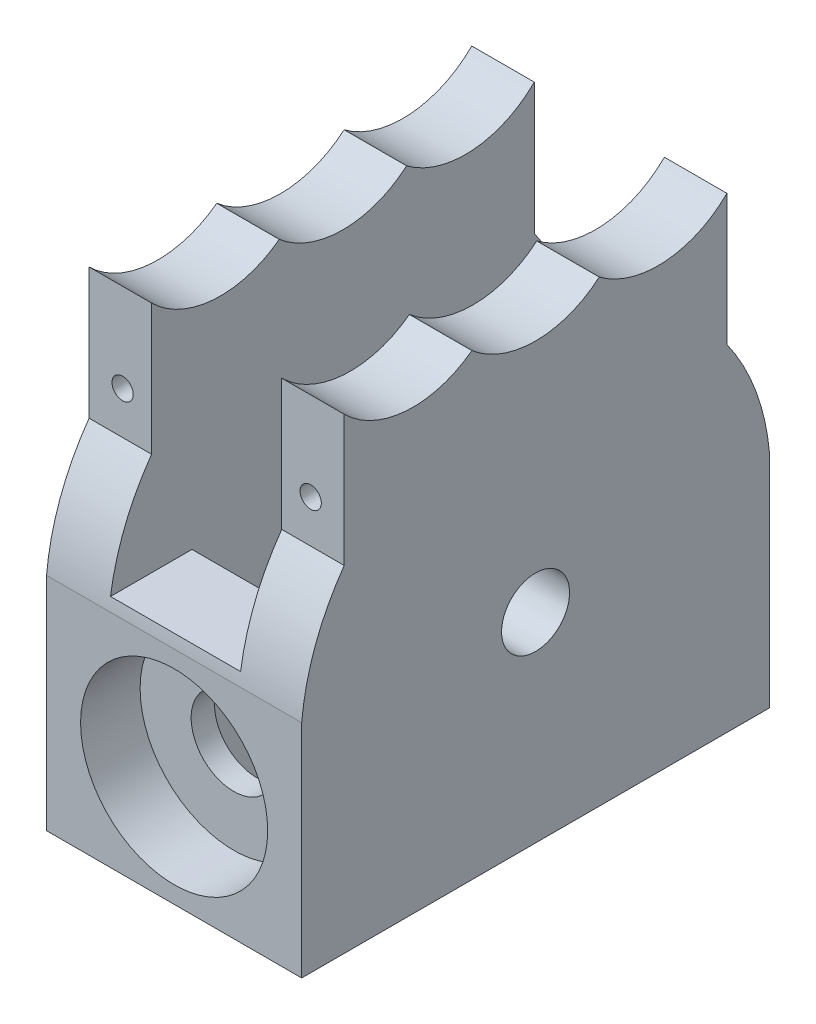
ISO-10303-21;
HEADER;
FILE_DESCRIPTION(('STEP AP214'),'2;1');
FILE_NAME('part.step','',(''),(''),'','','');
FILE_SCHEMA(('AUTOMOTIVE_DESIGN { 1 0 10303 214 1 1 1 1 }'));
ENDSEC;
DATA;
#1=APPLICATION_CONTEXT('core data for automotive mechanical design processes');
#2=APPLICATION_PROTOCOL_DEFINITION('international standard','automotive_design',2000,#1);
#3=PRODUCT_CONTEXT('',#1,'mechanical');
#4=PRODUCT('Part','Part','',(#3));
#5=PRODUCT_RELATED_PRODUCT_CATEGORY('part','',(#4));
#6=PRODUCT_DEFINITION_FORMATION('','',#4);
#7=PRODUCT_DEFINITION_CONTEXT('part definition',#1,'design');
#8=PRODUCT_DEFINITION('design','',#6,#7);
#9=PRODUCT_DEFINITION_SHAPE('','',#8);
#10=(LENGTH_UNIT() NAMED_UNIT(*) SI_UNIT(.MILLI.,.METRE.));
#11=(NAMED_UNIT(*) PLANE_ANGLE_UNIT() SI_UNIT($,.RADIAN.));
#12=(NAMED_UNIT(*) SI_UNIT($,.STERADIAN.) SOLID_ANGLE_UNIT());
#13=UNCERTAINTY_MEASURE_WITH_UNIT(LENGTH_MEASURE(1.E-05),#10,'distance_accuracy_value','');
#14=(GEOMETRIC_REPRESENTATION_CONTEXT(3) GLOBAL_UNCERTAINTY_ASSIGNED_CONTEXT((#13)) GLOBAL_UNIT_ASSIGNED_CONTEXT((#10,
#11,#12)) REPRESENTATION_CONTEXT('',''));
#15=CARTESIAN_POINT('',(0.,0.,0.));
#16=DIRECTION('',(0.,0.,1.));
#17=DIRECTION('',(1.,0.,0.));
#18=AXIS2_PLACEMENT_3D('',#15,#16,#17);
#19=CARTESIAN_POINT('',(42.2649293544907,0.,-22.5));
#20=DIRECTION('',(0.,0.,1.));
#21=DIRECTION('',(0.,-1.,0.));
#22=AXIS2_PLACEMENT_3D('',#19,#20,#21);
#23=PLANE('',#22);
#24=DIRECTION('',(-1.,0.,0.));
#25=VECTOR('',#24,1.);
#26=CARTESIAN_POINT('',(42.2649293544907,26.5078105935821,-22.5));
#27=LINE('',#26,#25);
#28=CARTESIAN_POINT('',(15.,26.5078105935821,-22.5));
#29=VERTEX_POINT('',#28);
#30=CARTESIAN_POINT('',(7.65,26.5078105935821,-22.5));
#31=VERTEX_POINT('',#30);
#32=EDGE_CURVE('E320',#29,#31,#27,.T.);
#33=ORIENTED_EDGE('',*,*,#32,.T.);
#34=DIRECTION('',(0.,1.,0.));
#35=VECTOR('',#34,1.);
#36=CARTESIAN_POINT('',(7.65,0.,-22.5));
#37=LINE('',#36,#35);
#38=CARTESIAN_POINT('',(7.65,41.9067187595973,-22.5));
#39=VERTEX_POINT('',#38);
#40=EDGE_CURVE('E194',#31,#39,#37,.T.);
#41=ORIENTED_EDGE('',*,*,#40,.T.);
#42=DIRECTION('',(-1.,0.,0.));
#43=VECTOR('',#42,1.);
#44=CARTESIAN_POINT('',(42.2649293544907,41.9067187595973,-22.5));
#45=LINE('',#44,#43);
#46=CARTESIAN_POINT('',(15.,41.9067187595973,-22.5));
#47=VERTEX_POINT('',#46);
#48=EDGE_CURVE('E323',#47,#39,#45,.T.);
#49=ORIENTED_EDGE('',*,*,#48,.F.);
#50=DIRECTION('',(0.,-1.,0.));
#51=VECTOR('',#50,1.);
#52=CARTESIAN_POINT('',(15.,0.,-22.5));
#53=LINE('',#52,#51);
#54=EDGE_CURVE('E303',#47,#29,#53,.T.);
#55=ORIENTED_EDGE('',*,*,#54,.T.);
#56=EDGE_LOOP('',(#33,#41,#49,#55));
#57=FACE_BOUND('',#56,.T.);
#58=ADVANCED_FACE('F35',(#57),#23,.F.);
#59=CARTESIAN_POINT('',(42.2649293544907,50.0736536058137,-14.4036319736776));
#60=DIRECTION('',(-1.,0.,0.));
#61=DIRECTION('',(0.,0.,1.));
#62=AXIS2_PLACEMENT_3D('',#59,#60,#61);
#63=CYLINDRICAL_SURFACE('',#62,11.5);
#64=ORIENTED_EDGE('',*,*,#48,.T.);
#65=CARTESIAN_POINT('',(7.65,50.0736536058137,-14.4036319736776));
#66=DIRECTION('',(1.,0.,0.));
#67=DIRECTION('',(0.,0.,-1.));
#68=AXIS2_PLACEMENT_3D('',#65,#66,#67);
#69=CIRCLE('',#68,11.5);
#70=CARTESIAN_POINT('',(7.65,40.8853502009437,-7.48806398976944));
#71=VERTEX_POINT('',#70);
#72=EDGE_CURVE('E257',#39,#71,#69,.F.);
#73=ORIENTED_EDGE('',*,*,#72,.T.);
#74=DIRECTION('',(-1.,0.,0.));
#75=VECTOR('',#74,1.);
#76=CARTESIAN_POINT('',(42.2649293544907,40.8853502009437,-7.48806398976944));
#77=LINE('',#76,#75);
#78=CARTESIAN_POINT('',(15.,40.8853502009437,-7.48806398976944));
#79=VERTEX_POINT('',#78);
#80=EDGE_CURVE('E316',#79,#71,#77,.T.);
#81=ORIENTED_EDGE('',*,*,#80,.F.);
#82=CARTESIAN_POINT('',(15.,50.0736536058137,-14.4036319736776));
#83=DIRECTION('',(-1.,0.,0.));
#84=DIRECTION('',(0.,0.,1.));
#85=AXIS2_PLACEMENT_3D('',#82,#83,#84);
#86=CIRCLE('',#85,11.5);
#87=EDGE_CURVE('E302',#79,#47,#86,.F.);
#88=ORIENTED_EDGE('',*,*,#87,.T.);
#89=EDGE_LOOP('',(#64,#73,#81,#88));
#90=FACE_BOUND('',#89,.T.);
#91=ADVANCED_FACE('F392',(#90),#63,.F.);
#92=CARTESIAN_POINT('',(42.2649293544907,0.,22.5));
#93=DIRECTION('',(0.,0.,1.));
#94=DIRECTION('',(0.,-1.,0.));
#95=AXIS2_PLACEMENT_3D('',#92,#93,#94);
#96=PLANE('',#95);
#97=DIRECTION('',(0.,1.,0.));
#98=VECTOR('',#97,1.);
#99=CARTESIAN_POINT('',(7.65,0.,22.5));
#100=LINE('',#99,#98);
#101=CARTESIAN_POINT('',(7.65,26.5078105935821,22.5));
#102=VERTEX_POINT('',#101);
#103=CARTESIAN_POINT('',(7.65,41.9067187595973,22.5));
#104=VERTEX_POINT('',#103);
#105=EDGE_CURVE('E199',#102,#104,#100,.T.);
#106=ORIENTED_EDGE('',*,*,#105,.F.);
#107=DIRECTION('',(-1.,0.,0.));
#108=VECTOR('',#107,1.);
#109=CARTESIAN_POINT('',(42.2649293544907,26.5078105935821,22.5));
#110=LINE('',#109,#108);
#111=CARTESIAN_POINT('',(15.,26.5078105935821,22.5));
#112=VERTEX_POINT('',#111);
#113=EDGE_CURVE('E293',#112,#102,#110,.T.);
#114=ORIENTED_EDGE('',*,*,#113,.F.);
#115=DIRECTION('',(0.,-1.,0.));
#116=VECTOR('',#115,1.);
#117=CARTESIAN_POINT('',(15.,0.,22.5));
#118=LINE('',#117,#116);
#119=CARTESIAN_POINT('',(15.,41.9067187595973,22.5));
#120=VERTEX_POINT('',#119);
#121=EDGE_CURVE('E277',#120,#112,#118,.T.);
#122=ORIENTED_EDGE('',*,*,#121,.F.);
#123=DIRECTION('',(-1.,0.,0.));
#124=VECTOR('',#123,1.);
#125=CARTESIAN_POINT('',(42.2649293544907,41.9067187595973,22.5));
#126=LINE('',#125,#124);
#127=EDGE_CURVE('E281',#120,#104,#126,.T.);
#128=ORIENTED_EDGE('',*,*,#127,.T.);
#129=EDGE_LOOP('',(#106,#114,#122,#128));
#130=FACE_BOUND('',#129,.T.);
#131=CARTESIAN_POINT('',(11.056594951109,31.5042089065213,22.5));
#132=DIRECTION('',(0.,0.,1.));
#133=DIRECTION('',(0.,-1.,0.));
#134=AXIS2_PLACEMENT_3D('',#131,#132,#133);
#135=CIRCLE('',#134,1.25);
#136=CARTESIAN_POINT('',(11.056594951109,30.2542089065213,22.5));
#137=VERTEX_POINT('',#136);
#138=EDGE_CURVE('E237',#137,#137,#135,.T.);
#139=ORIENTED_EDGE('',*,*,#138,.F.);
#140=EDGE_LOOP('',(#139));
#141=FACE_BOUND('',#140,.T.);
#142=ADVANCED_FACE('F389',(#130,#141),#96,.T.);
#143=CARTESIAN_POINT('',(42.2649293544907,50.0736536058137,14.4036319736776));
#144=DIRECTION('',(-1.,0.,0.));
#145=DIRECTION('',(0.,0.,1.));
#146=AXIS2_PLACEMENT_3D('',#143,#144,#145);
#147=CYLINDRICAL_SURFACE('',#146,11.5);
#148=CARTESIAN_POINT('',(7.65,50.0736536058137,14.4036319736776));
#149=DIRECTION('',(1.,0.,0.));
#150=DIRECTION('',(0.,0.,-1.));
#151=AXIS2_PLACEMENT_3D('',#148,#149,#150);
#152=CIRCLE('',#151,11.5);
#153=CARTESIAN_POINT('',(7.65,40.8853502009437,7.48806398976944));
#154=VERTEX_POINT('',#153);
#155=EDGE_CURVE('E44',#104,#154,#152,.T.);
#156=ORIENTED_EDGE('',*,*,#155,.F.);
#157=ORIENTED_EDGE('',*,*,#127,.F.);
#158=CARTESIAN_POINT('',(15.,50.0736536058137,14.4036319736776));
#159=DIRECTION('',(-1.,0.,0.));
#160=DIRECTION('',(0.,0.,1.));
#161=AXIS2_PLACEMENT_3D('',#158,#159,#160);
#162=CIRCLE('',#161,11.5);
#163=CARTESIAN_POINT('',(15.,40.8853502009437,7.48806398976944));
#164=VERTEX_POINT('',#163);
#165=EDGE_CURVE('E280',#164,#120,#162,.T.);
#166=ORIENTED_EDGE('',*,*,#165,.F.);
#167=DIRECTION('',(-1.,0.,0.));
#168=VECTOR('',#167,1.);
#169=CARTESIAN_POINT('',(42.2649293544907,40.8853502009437,7.48806398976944));
#170=LINE('',#169,#168);
#171=EDGE_CURVE('E297',#164,#154,#170,.T.);
#172=ORIENTED_EDGE('',*,*,#171,.T.);
#173=EDGE_LOOP('',(#156,#157,#166,#172));
#174=FACE_BOUND('',#173,.T.);
#175=ADVANCED_FACE('F391',(#174),#147,.F.);
#176=CARTESIAN_POINT('',(0.,0.,-41.642135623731));
#177=DIRECTION('',(0.,0.,1.));
#178=DIRECTION('',(1.,0.,0.));
#179=AXIS2_PLACEMENT_3D('',#176,#177,#178);
#180=CYLINDRICAL_SURFACE('',#179,5.);
#181=CARTESIAN_POINT('',(0.,0.,17.75));
#182=DIRECTION('',(0.,0.,1.));
#183=DIRECTION('',(1.,0.,0.));
#184=AXIS2_PLACEMENT_3D('',#181,#182,#183);
#185=CIRCLE('',#184,5.);
#186=CARTESIAN_POINT('',(5.,0.,17.75));
#187=VERTEX_POINT('',#186);
#188=EDGE_CURVE('E263',#187,#187,#185,.F.);
#189=ORIENTED_EDGE('',*,*,#188,.T.);
#190=EDGE_LOOP('',(#189));
#191=FACE_BOUND('',#190,.T.);
#192=CARTESIAN_POINT('',(0.,0.,20.5));
#193=DIRECTION('',(0.,0.,1.));
#194=DIRECTION('',(1.,0.,0.));
#195=AXIS2_PLACEMENT_3D('',#192,#193,#194);
#196=CIRCLE('',#195,5.);
#197=CARTESIAN_POINT('',(5.,0.,20.5));
#198=VERTEX_POINT('',#197);
#199=EDGE_CURVE('E350',#198,#198,#196,.F.);
#200=ORIENTED_EDGE('',*,*,#199,.F.);
#201=EDGE_LOOP('',(#200));
#202=FACE_BOUND('',#201,.T.);
#203=ADVANCED_FACE('F400',(#191,#202),#180,.F.);
#204=CARTESIAN_POINT('',(15.,10.5,0.));
#205=DIRECTION('',(-1.,0.,0.));
#206=DIRECTION('',(0.,0.,1.));
#207=AXIS2_PLACEMENT_3D('',#204,#205,#206);
#208=CYLINDRICAL_SURFACE('',#207,4.);
#209=CARTESIAN_POINT('',(-7.65,10.5,0.));
#210=DIRECTION('',(-1.,0.,0.));
#211=DIRECTION('',(0.,0.,1.));
#212=AXIS2_PLACEMENT_3D('',#209,#210,#211);
#213=CIRCLE('',#212,4.);
#214=CARTESIAN_POINT('',(-7.65,10.5,4.));
#215=VERTEX_POINT('',#214);
#216=EDGE_CURVE('E270',#215,#215,#213,.F.);
#217=ORIENTED_EDGE('',*,*,#216,.T.);
#218=EDGE_LOOP('',(#217));
#219=FACE_BOUND('',#218,.T.);
#220=CARTESIAN_POINT('',(-15.,10.5,0.));
#221=DIRECTION('',(-1.,0.,0.));
#222=DIRECTION('',(0.,0.,1.));
#223=AXIS2_PLACEMENT_3D('',#220,#221,#222);
#224=CIRCLE('',#223,4.);
#225=CARTESIAN_POINT('',(-15.,10.5,4.));
#226=VERTEX_POINT('',#225);
#227=EDGE_CURVE('E306',#226,#226,#224,.T.);
#228=ORIENTED_EDGE('',*,*,#227,.T.);
#229=EDGE_LOOP('',(#228));
#230=FACE_BOUND('',#229,.T.);
#231=ADVANCED_FACE('F431',(#219,#230),#208,.F.);
#232=CARTESIAN_POINT('',(42.2649293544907,49.6134025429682,0.));
#233=DIRECTION('',(-1.,0.,0.));
#234=DIRECTION('',(0.,0.,1.));
#235=AXIS2_PLACEMENT_3D('',#232,#233,#234);
#236=CYLINDRICAL_SURFACE('',#235,11.5);
#237=CARTESIAN_POINT('',(-7.65,49.6134025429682,0.));
#238=DIRECTION('',(-1.,0.,0.));
#239=DIRECTION('',(0.,0.,1.));
#240=AXIS2_PLACEMENT_3D('',#237,#238,#239);
#241=CIRCLE('',#240,11.5);
#242=CARTESIAN_POINT('',(-7.65,40.8853502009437,-7.48806398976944));
#243=VERTEX_POINT('',#242);
#244=CARTESIAN_POINT('',(-7.65,40.8853502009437,7.48806398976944));
#245=VERTEX_POINT('',#244);
#246=EDGE_CURVE('E266',#243,#245,#241,.T.);
#247=ORIENTED_EDGE('',*,*,#246,.F.);
#248=CARTESIAN_POINT('',(-15.,40.8853502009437,-7.48806398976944));
#249=VERTEX_POINT('',#248);
#250=EDGE_CURVE('E319',#243,#249,#77,.T.);
#251=ORIENTED_EDGE('',*,*,#250,.T.);
#252=CARTESIAN_POINT('',(-15.,49.6134025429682,0.));
#253=DIRECTION('',(-1.,0.,0.));
#254=DIRECTION('',(0.,0.,1.));
#255=AXIS2_PLACEMENT_3D('',#252,#253,#254);
#256=CIRCLE('',#255,11.5);
#257=CARTESIAN_POINT('',(-15.,40.8853502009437,7.48806398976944));
#258=VERTEX_POINT('',#257);
#259=EDGE_CURVE('E312',#258,#249,#256,.F.);
#260=ORIENTED_EDGE('',*,*,#259,.F.);
#261=EDGE_CURVE('E289',#245,#258,#170,.T.);
#262=ORIENTED_EDGE('',*,*,#261,.F.);
#263=EDGE_LOOP('',(#247,#251,#260,#262));
#264=FACE_BOUND('',#263,.T.);
#265=ADVANCED_FACE('F427',(#264),#236,.F.);
#266=CARTESIAN_POINT('',(75.4622443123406,10.5,0.));
#267=DIRECTION('',(-1.,0.,0.));
#268=DIRECTION('',(0.,0.,1.));
#269=AXIS2_PLACEMENT_3D('',#266,#267,#268);
#270=CYLINDRICAL_SURFACE('',#269,27.6134025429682);
#271=CARTESIAN_POINT('',(7.65,10.5,0.));
#272=DIRECTION('',(1.,0.,0.));
#273=DIRECTION('',(0.,0.,-1.));
#274=AXIS2_PLACEMENT_3D('',#271,#272,#273);
#275=CIRCLE('',#274,27.6134025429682);
#276=CARTESIAN_POINT('',(7.65000000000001,14.4422863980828,-27.3305392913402));
#277=VERTEX_POINT('',#276);
#278=EDGE_CURVE('E187',#31,#277,#275,.F.);
#279=ORIENTED_EDGE('',*,*,#278,.F.);
#280=ORIENTED_EDGE('',*,*,#32,.F.);
#281=CARTESIAN_POINT('',(15.,10.5,0.));
#282=DIRECTION('',(-1.,0.,0.));
#283=DIRECTION('',(0.,0.,1.));
#284=AXIS2_PLACEMENT_3D('',#281,#282,#283);
#285=CIRCLE('',#284,27.6134025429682);
#286=CARTESIAN_POINT('',(15.,13.,-27.5));
#287=VERTEX_POINT('',#286);
#288=EDGE_CURVE('E333',#287,#29,#285,.F.);
#289=ORIENTED_EDGE('',*,*,#288,.F.);
#290=DIRECTION('',(-1.,0.,0.));
#291=VECTOR('',#290,1.);
#292=CARTESIAN_POINT('',(-15.,13.,-27.5));
#293=LINE('',#292,#291);
#294=CARTESIAN_POINT('',(-15.,13.,-27.5));
#295=VERTEX_POINT('',#294);
#296=EDGE_CURVE('E368',#287,#295,#293,.T.);
#297=ORIENTED_EDGE('',*,*,#296,.T.);
#298=CARTESIAN_POINT('',(-15.,10.5,0.));
#299=DIRECTION('',(-1.,0.,0.));
#300=DIRECTION('',(0.,0.,1.));
#301=AXIS2_PLACEMENT_3D('',#298,#299,#300);
#302=CIRCLE('',#301,27.6134025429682);
#303=CARTESIAN_POINT('',(-15.,26.5078105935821,-22.5));
#304=VERTEX_POINT('',#303);
#305=EDGE_CURVE('E330',#304,#295,#302,.T.);
#306=ORIENTED_EDGE('',*,*,#305,.F.);
#307=CARTESIAN_POINT('',(-7.65,26.5078105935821,-22.5));
#308=VERTEX_POINT('',#307);
#309=EDGE_CURVE('E322',#308,#304,#27,.T.);
#310=ORIENTED_EDGE('',*,*,#309,.F.);
#311=CARTESIAN_POINT('',(-7.64999999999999,10.5,0.));
#312=DIRECTION('',(-1.,0.,0.));
#313=DIRECTION('',(0.,0.,1.));
#314=AXIS2_PLACEMENT_3D('',#311,#312,#313);
#315=CIRCLE('',#314,27.6134025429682);
#316=CARTESIAN_POINT('',(-7.64999999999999,14.4422863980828,-27.3305392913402));
#317=VERTEX_POINT('',#316);
#318=EDGE_CURVE('E212',#317,#308,#315,.F.);
#319=ORIENTED_EDGE('',*,*,#318,.F.);
#320=DIRECTION('',(-1.,0.,0.));
#321=VECTOR('',#320,1.);
#322=CARTESIAN_POINT('',(75.4622443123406,14.4422863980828,-27.3305392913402));
#323=LINE('',#322,#321);
#324=EDGE_CURVE('E203',#277,#317,#323,.T.);
#325=ORIENTED_EDGE('',*,*,#324,.F.);
#326=EDGE_LOOP('',(#279,#280,#289,#297,#306,#310,#319,#325));
#327=FACE_BOUND('',#326,.T.);
#328=ADVANCED_FACE('F210',(#327),#270,.T.);
#329=CARTESIAN_POINT('',(7.65,10.5,0.));
#330=DIRECTION('',(1.,0.,0.));
#331=DIRECTION('',(0.,0.,-1.));
#332=AXIS2_PLACEMENT_3D('',#329,#330,#331);
#333=CIRCLE('',#332,27.6134025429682);
#334=CARTESIAN_POINT('',(7.65000000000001,14.4422863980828,27.3305392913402));
#335=VERTEX_POINT('',#334);
#336=EDGE_CURVE('E229',#335,#102,#333,.F.);
#337=ORIENTED_EDGE('',*,*,#336,.F.);
#338=DIRECTION('',(-1.,0.,0.));
#339=VECTOR('',#338,1.);
#340=CARTESIAN_POINT('',(75.4622443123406,14.4422863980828,27.3305392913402));
#341=LINE('',#340,#339);
#342=CARTESIAN_POINT('',(-7.64999999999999,14.4422863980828,27.3305392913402));
#343=VERTEX_POINT('',#342);
#344=EDGE_CURVE('E214',#343,#335,#341,.F.);
#345=ORIENTED_EDGE('',*,*,#344,.F.);
#346=CARTESIAN_POINT('',(-7.64999999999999,10.5,0.));
#347=DIRECTION('',(-1.,0.,0.));
#348=DIRECTION('',(0.,0.,1.));
#349=AXIS2_PLACEMENT_3D('',#346,#347,#348);
#350=CIRCLE('',#349,27.6134025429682);
#351=CARTESIAN_POINT('',(-7.65,26.5078105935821,22.5));
#352=VERTEX_POINT('',#351);
#353=EDGE_CURVE('E216',#352,#343,#350,.F.);
#354=ORIENTED_EDGE('',*,*,#353,.F.);
#355=CARTESIAN_POINT('',(-15.,26.5078105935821,22.5));
#356=VERTEX_POINT('',#355);
#357=EDGE_CURVE('E296',#352,#356,#110,.T.);
#358=ORIENTED_EDGE('',*,*,#357,.T.);
#359=CARTESIAN_POINT('',(-15.,13.,27.5));
#360=VERTEX_POINT('',#359);
#361=EDGE_CURVE('E338',#360,#356,#302,.T.);
#362=ORIENTED_EDGE('',*,*,#361,.F.);
#363=DIRECTION('',(-1.,0.,0.));
#364=VECTOR('',#363,1.);
#365=CARTESIAN_POINT('',(-15.,13.,27.5));
#366=LINE('',#365,#364);
#367=CARTESIAN_POINT('',(15.,13.,27.5));
#368=VERTEX_POINT('',#367);
#369=EDGE_CURVE('E357',#368,#360,#366,.T.);
#370=ORIENTED_EDGE('',*,*,#369,.F.);
#371=EDGE_CURVE('E337',#112,#368,#285,.F.);
#372=ORIENTED_EDGE('',*,*,#371,.F.);
#373=ORIENTED_EDGE('',*,*,#113,.T.);
#374=EDGE_LOOP('',(#337,#345,#354,#358,#362,#370,#372,#373));
#375=FACE_BOUND('',#374,.T.);
#376=ADVANCED_FACE('F463',(#375),#270,.T.);
#377=CARTESIAN_POINT('',(0.,0.,-17.75));
#378=DIRECTION('',(0.,0.,-1.));
#379=DIRECTION('',(-1.,0.,0.));
#380=AXIS2_PLACEMENT_3D('',#377,#378,#379);
#381=CIRCLE('',#380,5.);
#382=CARTESIAN_POINT('',(-5.,0.,-17.75));
#383=VERTEX_POINT('',#382);
#384=EDGE_CURVE('E273',#383,#383,#381,.F.);
#385=ORIENTED_EDGE('',*,*,#384,.T.);
#386=EDGE_LOOP('',(#385));
#387=FACE_BOUND('',#386,.T.);
#388=CARTESIAN_POINT('',(0.,0.,-20.5));
#389=DIRECTION('',(0.,0.,-1.));
#390=DIRECTION('',(-1.,0.,0.));
#391=AXIS2_PLACEMENT_3D('',#388,#389,#390);
#392=CIRCLE('',#391,5.);
#393=CARTESIAN_POINT('',(-5.,0.,-20.5));
#394=VERTEX_POINT('',#393);
#395=EDGE_CURVE('E344',#394,#394,#392,.F.);
#396=ORIENTED_EDGE('',*,*,#395,.F.);
#397=EDGE_LOOP('',(#396));
#398=FACE_BOUND('',#397,.T.);
#399=ADVANCED_FACE('F518',(#387,#398),#180,.F.);
#400=CARTESIAN_POINT('',(15.,-13.,27.5));
#401=DIRECTION('',(-1.,0.,0.));
#402=DIRECTION('',(0.,0.,1.));
#403=AXIS2_PLACEMENT_3D('',#400,#401,#402);
#404=PLANE('',#403);
#405=CARTESIAN_POINT('',(15.,10.5,0.));
#406=DIRECTION('',(-1.,0.,0.));
#407=DIRECTION('',(0.,0.,1.));
#408=AXIS2_PLACEMENT_3D('',#405,#406,#407);
#409=CIRCLE('',#408,4.);
#410=CARTESIAN_POINT('',(15.,10.5,4.));
#411=VERTEX_POINT('',#410);
#412=EDGE_CURVE('E327',#411,#411,#409,.T.);
#413=ORIENTED_EDGE('',*,*,#412,.T.);
#414=EDGE_LOOP('',(#413));
#415=FACE_BOUND('',#414,.T.);
#416=DIRECTION('',(0.,1.,0.));
#417=VECTOR('',#416,1.);
#418=CARTESIAN_POINT('',(15.,-13.,-27.5));
#419=LINE('',#418,#417);
#420=CARTESIAN_POINT('',(15.,-13.,-27.5));
#421=VERTEX_POINT('',#420);
#422=EDGE_CURVE('E365',#421,#287,#419,.T.);
#423=ORIENTED_EDGE('',*,*,#422,.T.);
#424=ORIENTED_EDGE('',*,*,#288,.T.);
#425=ORIENTED_EDGE('',*,*,#54,.F.);
#426=ORIENTED_EDGE('',*,*,#87,.F.);
#427=CARTESIAN_POINT('',(15.,49.6134025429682,0.));
#428=DIRECTION('',(-1.,0.,0.));
#429=DIRECTION('',(0.,0.,1.));
#430=AXIS2_PLACEMENT_3D('',#427,#428,#429);
#431=CIRCLE('',#430,11.5);
#432=EDGE_CURVE('E300',#79,#164,#431,.T.);
#433=ORIENTED_EDGE('',*,*,#432,.T.);
#434=ORIENTED_EDGE('',*,*,#165,.T.);
#435=ORIENTED_EDGE('',*,*,#121,.T.);
#436=ORIENTED_EDGE('',*,*,#371,.T.);
#437=DIRECTION('',(0.,1.,0.));
#438=VECTOR('',#437,1.);
#439=CARTESIAN_POINT('',(15.,-13.,27.5));
#440=LINE('',#439,#438);
#441=CARTESIAN_POINT('',(15.,-13.,27.5));
#442=VERTEX_POINT('',#441);
#443=EDGE_CURVE('E354',#442,#368,#440,.T.);
#444=ORIENTED_EDGE('',*,*,#443,.F.);
#445=DIRECTION('',(0.,0.,-1.));
#446=VECTOR('',#445,1.);
#447=CARTESIAN_POINT('',(15.,-13.,27.5));
#448=LINE('',#447,#446);
#449=EDGE_CURVE('E364',#442,#421,#448,.T.);
#450=ORIENTED_EDGE('',*,*,#449,.T.);
#451=EDGE_LOOP('',(#423,#424,#425,#426,#433,#434,#435,#436,#444,#450));
#452=FACE_BOUND('',#451,.T.);
#453=ADVANCED_FACE('F37',(#415,#452),#404,.F.);
#454=CARTESIAN_POINT('',(-15.,-13.,27.5));
#455=DIRECTION('',(1.,0.,0.));
#456=DIRECTION('',(0.,0.,-1.));
#457=AXIS2_PLACEMENT_3D('',#454,#455,#456);
#458=PLANE('',#457);
#459=ORIENTED_EDGE('',*,*,#227,.F.);
#460=EDGE_LOOP('',(#459));
#461=FACE_BOUND('',#460,.T.);
#462=DIRECTION('',(0.,-1.,0.));
#463=VECTOR('',#462,1.);
#464=CARTESIAN_POINT('',(-15.,-13.,-27.5));
#465=LINE('',#464,#463);
#466=CARTESIAN_POINT('',(-15.,-13.,-27.5));
#467=VERTEX_POINT('',#466);
#468=EDGE_CURVE('E371',#295,#467,#465,.T.);
#469=ORIENTED_EDGE('',*,*,#468,.T.);
#470=DIRECTION('',(0.,0.,-1.));
#471=VECTOR('',#470,1.);
#472=CARTESIAN_POINT('',(-15.,-13.,27.5));
#473=LINE('',#472,#471);
#474=CARTESIAN_POINT('',(-15.,-13.,27.5));
#475=VERTEX_POINT('',#474);
#476=EDGE_CURVE('E376',#475,#467,#473,.T.);
#477=ORIENTED_EDGE('',*,*,#476,.F.);
#478=DIRECTION('',(0.,-1.,0.));
#479=VECTOR('',#478,1.);
#480=CARTESIAN_POINT('',(-15.,-13.,27.5));
#481=LINE('',#480,#479);
#482=EDGE_CURVE('E360',#360,#475,#481,.T.);
#483=ORIENTED_EDGE('',*,*,#482,.F.);
#484=ORIENTED_EDGE('',*,*,#361,.T.);
#485=DIRECTION('',(0.,1.,0.));
#486=VECTOR('',#485,1.);
#487=CARTESIAN_POINT('',(-15.,0.,22.5));
#488=LINE('',#487,#486);
#489=CARTESIAN_POINT('',(-15.,41.9067187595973,22.5));
#490=VERTEX_POINT('',#489);
#491=EDGE_CURVE('E286',#356,#490,#488,.T.);
#492=ORIENTED_EDGE('',*,*,#491,.T.);
#493=CARTESIAN_POINT('',(-15.,50.0736536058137,14.4036319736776));
#494=DIRECTION('',(1.,0.,0.));
#495=DIRECTION('',(0.,0.,-1.));
#496=AXIS2_PLACEMENT_3D('',#493,#494,#495);
#497=CIRCLE('',#496,11.5);
#498=EDGE_CURVE('E276',#490,#258,#497,.T.);
#499=ORIENTED_EDGE('',*,*,#498,.T.);
#500=ORIENTED_EDGE('',*,*,#259,.T.);
#501=CARTESIAN_POINT('',(-15.,50.0736536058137,-14.4036319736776));
#502=DIRECTION('',(-1.,0.,0.));
#503=DIRECTION('',(0.,0.,1.));
#504=AXIS2_PLACEMENT_3D('',#501,#502,#503);
#505=CIRCLE('',#504,11.5);
#506=CARTESIAN_POINT('',(-15.,41.9067187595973,-22.5));
#507=VERTEX_POINT('',#506);
#508=EDGE_CURVE('E283',#507,#249,#505,.T.);
#509=ORIENTED_EDGE('',*,*,#508,.F.);
#510=DIRECTION('',(0.,1.,0.));
#511=VECTOR('',#510,1.);
#512=CARTESIAN_POINT('',(-15.,0.,-22.5));
#513=LINE('',#512,#511);
#514=EDGE_CURVE('E309',#304,#507,#513,.T.);
#515=ORIENTED_EDGE('',*,*,#514,.F.);
#516=ORIENTED_EDGE('',*,*,#305,.T.);
#517=EDGE_LOOP('',(#469,#477,#483,#484,#492,#499,#500,#509,#515,#516));
#518=FACE_BOUND('',#517,.T.);
#519=ADVANCED_FACE('F486',(#461,#518),#458,.F.);
#520=CARTESIAN_POINT('',(-15.,-13.,27.5));
#521=DIRECTION('',(0.,1.,0.));
#522=DIRECTION('',(0.,0.,1.));
#523=AXIS2_PLACEMENT_3D('',#520,#521,#522);
#524=PLANE('',#523);
#525=DIRECTION('',(1.,0.,0.));
#526=VECTOR('',#525,1.);
#527=CARTESIAN_POINT('',(7.65,-13.,-17.75));
#528=LINE('',#527,#526);
#529=CARTESIAN_POINT('',(-7.65,-13.,-17.75));
#530=VERTEX_POINT('',#529);
#531=CARTESIAN_POINT('',(7.65,-13.,-17.75));
#532=VERTEX_POINT('',#531);
#533=EDGE_CURVE('E240',#530,#532,#528,.T.);
#534=ORIENTED_EDGE('',*,*,#533,.F.);
#535=DIRECTION('',(0.,0.,-1.));
#536=VECTOR('',#535,1.);
#537=CARTESIAN_POINT('',(-7.65,-13.,-17.75));
#538=LINE('',#537,#536);
#539=CARTESIAN_POINT('',(-7.65,-13.,17.75));
#540=VERTEX_POINT('',#539);
#541=EDGE_CURVE('E238',#540,#530,#538,.T.);
#542=ORIENTED_EDGE('',*,*,#541,.F.);
#543=DIRECTION('',(-1.,0.,0.));
#544=VECTOR('',#543,1.);
#545=CARTESIAN_POINT('',(7.65,-13.,17.75));
#546=LINE('',#545,#544);
#547=CARTESIAN_POINT('',(7.65,-13.,17.75));
#548=VERTEX_POINT('',#547);
#549=EDGE_CURVE('E245',#548,#540,#546,.T.);
#550=ORIENTED_EDGE('',*,*,#549,.F.);
#551=DIRECTION('',(0.,0.,1.));
#552=VECTOR('',#551,1.);
#553=CARTESIAN_POINT('',(7.65,-13.,-17.75));
#554=LINE('',#553,#552);
#555=EDGE_CURVE('E242',#532,#548,#554,.T.);
#556=ORIENTED_EDGE('',*,*,#555,.F.);
#557=EDGE_LOOP('',(#534,#542,#550,#556));
#558=FACE_BOUND('',#557,.T.);
#559=DIRECTION('',(1.,0.,0.));
#560=VECTOR('',#559,1.);
#561=CARTESIAN_POINT('',(-15.,-13.,-27.5));
#562=LINE('',#561,#560);
#563=EDGE_CURVE('E358',#467,#421,#562,.T.);
#564=ORIENTED_EDGE('',*,*,#563,.T.);
#565=ORIENTED_EDGE('',*,*,#449,.F.);
#566=DIRECTION('',(1.,0.,0.));
#567=VECTOR('',#566,1.);
#568=CARTESIAN_POINT('',(-15.,-13.,27.5));
#569=LINE('',#568,#567);
#570=EDGE_CURVE('E362',#475,#442,#569,.T.);
#571=ORIENTED_EDGE('',*,*,#570,.F.);
#572=ORIENTED_EDGE('',*,*,#476,.T.);
#573=EDGE_LOOP('',(#564,#565,#571,#572));
#574=FACE_BOUND('',#573,.T.);
#575=ADVANCED_FACE('F452',(#558,#574),#524,.F.);
#576=CARTESIAN_POINT('',(0.,0.,27.5));
#577=DIRECTION('',(0.,0.,-1.));
#578=DIRECTION('',(-1.,0.,0.));
#579=AXIS2_PLACEMENT_3D('',#576,#577,#578);
#580=PLANE('',#579);
#581=CARTESIAN_POINT('',(0.,0.,27.5));
#582=DIRECTION('',(0.,0.,1.));
#583=DIRECTION('',(1.,0.,0.));
#584=AXIS2_PLACEMENT_3D('',#581,#582,#583);
#585=CIRCLE('',#584,11.);
#586=CARTESIAN_POINT('',(11.,0.,27.5));
#587=VERTEX_POINT('',#586);
#588=EDGE_CURVE('E351',#587,#587,#585,.T.);
#589=ORIENTED_EDGE('',*,*,#588,.F.);
#590=EDGE_LOOP('',(#589));
#591=FACE_BOUND('',#590,.T.);
#592=ORIENTED_EDGE('',*,*,#443,.T.);
#593=ORIENTED_EDGE('',*,*,#369,.T.);
#594=ORIENTED_EDGE('',*,*,#482,.T.);
#595=ORIENTED_EDGE('',*,*,#570,.T.);
#596=EDGE_LOOP('',(#592,#593,#594,#595));
#597=FACE_BOUND('',#596,.T.);
#598=ADVANCED_FACE('F503',(#591,#597),#580,.F.);
#599=CARTESIAN_POINT('',(0.,0.,-27.5));
#600=DIRECTION('',(0.,0.,-1.));
#601=DIRECTION('',(-1.,0.,0.));
#602=AXIS2_PLACEMENT_3D('',#599,#600,#601);
#603=PLANE('',#602);
#604=CARTESIAN_POINT('',(0.,0.,-27.5));
#605=DIRECTION('',(0.,0.,1.));
#606=DIRECTION('',(1.,0.,0.));
#607=AXIS2_PLACEMENT_3D('',#604,#605,#606);
#608=CIRCLE('',#607,11.);
#609=CARTESIAN_POINT('',(11.,0.,-27.5));
#610=VERTEX_POINT('',#609);
#611=EDGE_CURVE('E336',#610,#610,#608,.T.);
#612=ORIENTED_EDGE('',*,*,#611,.T.);
#613=EDGE_LOOP('',(#612));
#614=FACE_BOUND('',#613,.T.);
#615=ORIENTED_EDGE('',*,*,#422,.F.);
#616=ORIENTED_EDGE('',*,*,#563,.F.);
#617=ORIENTED_EDGE('',*,*,#468,.F.);
#618=ORIENTED_EDGE('',*,*,#296,.F.);
#619=EDGE_LOOP('',(#615,#616,#617,#618));
#620=FACE_BOUND('',#619,.T.);
#621=ADVANCED_FACE('F482',(#614,#620),#603,.T.);
#622=CARTESIAN_POINT('',(0.,0.,20.5));
#623=DIRECTION('',(0.,0.,1.));
#624=DIRECTION('',(1.,0.,0.));
#625=AXIS2_PLACEMENT_3D('',#622,#623,#624);
#626=PLANE('',#625);
#627=CARTESIAN_POINT('',(0.,0.,20.5));
#628=DIRECTION('',(0.,0.,1.));
#629=DIRECTION('',(1.,0.,0.));
#630=AXIS2_PLACEMENT_3D('',#627,#628,#629);
#631=CIRCLE('',#630,11.);
#632=CARTESIAN_POINT('',(11.,0.,20.5));
#633=VERTEX_POINT('',#632);
#634=EDGE_CURVE('E347',#633,#633,#631,.T.);
#635=ORIENTED_EDGE('',*,*,#634,.T.);
#636=EDGE_LOOP('',(#635));
#637=FACE_BOUND('',#636,.T.);
#638=ORIENTED_EDGE('',*,*,#199,.T.);
#639=EDGE_LOOP('',(#638));
#640=FACE_BOUND('',#639,.T.);
#641=ADVANCED_FACE('F515',(#637,#640),#626,.T.);
#642=CARTESIAN_POINT('',(0.,0.,20.5));
#643=DIRECTION('',(0.,0.,1.));
#644=DIRECTION('',(1.,0.,0.));
#645=AXIS2_PLACEMENT_3D('',#642,#643,#644);
#646=CYLINDRICAL_SURFACE('',#645,11.);
#647=ORIENTED_EDGE('',*,*,#634,.F.);
#648=EDGE_LOOP('',(#647));
#649=FACE_BOUND('',#648,.T.);
#650=ORIENTED_EDGE('',*,*,#588,.T.);
#651=EDGE_LOOP('',(#650));
#652=FACE_BOUND('',#651,.T.);
#653=ADVANCED_FACE('F522',(#649,#652),#646,.F.);
#654=CARTESIAN_POINT('',(0.,0.,-20.5));
#655=DIRECTION('',(0.,0.,-1.));
#656=DIRECTION('',(1.,0.,0.));
#657=AXIS2_PLACEMENT_3D('',#654,#655,#656);
#658=PLANE('',#657);
#659=CARTESIAN_POINT('',(0.,0.,-20.5));
#660=DIRECTION('',(0.,0.,1.));
#661=DIRECTION('',(1.,0.,0.));
#662=AXIS2_PLACEMENT_3D('',#659,#660,#661);
#663=CIRCLE('',#662,11.);
#664=CARTESIAN_POINT('',(11.,0.,-20.5));
#665=VERTEX_POINT('',#664);
#666=EDGE_CURVE('E341',#665,#665,#663,.T.);
#667=ORIENTED_EDGE('',*,*,#666,.F.);
#668=EDGE_LOOP('',(#667));
#669=FACE_BOUND('',#668,.T.);
#670=ORIENTED_EDGE('',*,*,#395,.T.);
#671=EDGE_LOOP('',(#670));
#672=FACE_BOUND('',#671,.T.);
#673=ADVANCED_FACE('F525',(#669,#672),#658,.T.);
#674=CARTESIAN_POINT('',(0.,0.,-20.5));
#675=DIRECTION('',(0.,0.,-1.));
#676=DIRECTION('',(-1.,0.,0.));
#677=AXIS2_PLACEMENT_3D('',#674,#675,#676);
#678=CYLINDRICAL_SURFACE('',#677,11.);
#679=ORIENTED_EDGE('',*,*,#666,.T.);
#680=EDGE_LOOP('',(#679));
#681=FACE_BOUND('',#680,.T.);
#682=ORIENTED_EDGE('',*,*,#611,.F.);
#683=EDGE_LOOP('',(#682));
#684=FACE_BOUND('',#683,.T.);
#685=ADVANCED_FACE('F428',(#681,#684),#678,.F.);
#686=CARTESIAN_POINT('',(7.65,10.5,0.));
#687=DIRECTION('',(1.,0.,0.));
#688=DIRECTION('',(0.,0.,-1.));
#689=AXIS2_PLACEMENT_3D('',#686,#687,#688);
#690=CIRCLE('',#689,4.);
#691=CARTESIAN_POINT('',(7.65,10.5,-4.));
#692=VERTEX_POINT('',#691);
#693=EDGE_CURVE('E260',#692,#692,#690,.F.);
#694=ORIENTED_EDGE('',*,*,#693,.T.);
#695=EDGE_LOOP('',(#694));
#696=FACE_BOUND('',#695,.T.);
#697=ORIENTED_EDGE('',*,*,#412,.F.);
#698=EDGE_LOOP('',(#697));
#699=FACE_BOUND('',#698,.T.);
#700=ADVANCED_FACE('F420',(#696,#699),#208,.F.);
#701=CARTESIAN_POINT('',(-7.65,41.9067187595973,-22.5));
#702=VERTEX_POINT('',#701);
#703=EDGE_CURVE('E315',#702,#507,#45,.T.);
#704=ORIENTED_EDGE('',*,*,#703,.F.);
#705=DIRECTION('',(0.,-1.,0.));
#706=VECTOR('',#705,1.);
#707=CARTESIAN_POINT('',(-7.65,0.,-22.5));
#708=LINE('',#707,#706);
#709=EDGE_CURVE('E222',#702,#308,#708,.T.);
#710=ORIENTED_EDGE('',*,*,#709,.T.);
#711=ORIENTED_EDGE('',*,*,#309,.T.);
#712=ORIENTED_EDGE('',*,*,#514,.T.);
#713=EDGE_LOOP('',(#704,#710,#711,#712));
#714=FACE_BOUND('',#713,.T.);
#715=ADVANCED_FACE('F414',(#714),#23,.F.);
#716=CARTESIAN_POINT('',(7.65,49.6134025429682,0.));
#717=DIRECTION('',(1.,0.,0.));
#718=DIRECTION('',(0.,0.,-1.));
#719=AXIS2_PLACEMENT_3D('',#716,#717,#718);
#720=CIRCLE('',#719,11.5);
#721=EDGE_CURVE('E250',#154,#71,#720,.T.);
#722=ORIENTED_EDGE('',*,*,#721,.F.);
#723=ORIENTED_EDGE('',*,*,#171,.F.);
#724=ORIENTED_EDGE('',*,*,#432,.F.);
#725=ORIENTED_EDGE('',*,*,#80,.T.);
#726=EDGE_LOOP('',(#722,#723,#724,#725));
#727=FACE_BOUND('',#726,.T.);
#728=ADVANCED_FACE('F419',(#727),#236,.F.);
#729=CARTESIAN_POINT('',(-7.65,50.0736536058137,-14.4036319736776));
#730=DIRECTION('',(-1.,0.,0.));
#731=DIRECTION('',(0.,0.,1.));
#732=AXIS2_PLACEMENT_3D('',#729,#730,#731);
#733=CIRCLE('',#732,11.5);
#734=EDGE_CURVE('E268',#243,#702,#733,.F.);
#735=ORIENTED_EDGE('',*,*,#734,.T.);
#736=ORIENTED_EDGE('',*,*,#703,.T.);
#737=ORIENTED_EDGE('',*,*,#508,.T.);
#738=ORIENTED_EDGE('',*,*,#250,.F.);
#739=EDGE_LOOP('',(#735,#736,#737,#738));
#740=FACE_BOUND('',#739,.T.);
#741=ADVANCED_FACE('F406',(#740),#63,.F.);
#742=DIRECTION('',(0.,-1.,0.));
#743=VECTOR('',#742,1.);
#744=CARTESIAN_POINT('',(-7.65,0.,22.5));
#745=LINE('',#744,#743);
#746=CARTESIAN_POINT('',(-7.65,41.9067187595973,22.5));
#747=VERTEX_POINT('',#746);
#748=EDGE_CURVE('E213',#747,#352,#745,.T.);
#749=ORIENTED_EDGE('',*,*,#748,.F.);
#750=EDGE_CURVE('E292',#747,#490,#126,.T.);
#751=ORIENTED_EDGE('',*,*,#750,.T.);
#752=ORIENTED_EDGE('',*,*,#491,.F.);
#753=ORIENTED_EDGE('',*,*,#357,.F.);
#754=EDGE_LOOP('',(#749,#751,#752,#753));
#755=FACE_BOUND('',#754,.T.);
#756=CARTESIAN_POINT('',(-11.056594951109,31.5042089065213,22.5));
#757=DIRECTION('',(0.,0.,1.));
#758=DIRECTION('',(0.,-1.,0.));
#759=AXIS2_PLACEMENT_3D('',#756,#757,#758);
#760=CIRCLE('',#759,1.25);
#761=CARTESIAN_POINT('',(-11.056594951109,30.2542089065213,22.5));
#762=VERTEX_POINT('',#761);
#763=EDGE_CURVE('E39',#762,#762,#760,.F.);
#764=ORIENTED_EDGE('',*,*,#763,.T.);
#765=EDGE_LOOP('',(#764));
#766=FACE_BOUND('',#765,.T.);
#767=ADVANCED_FACE('F395',(#755,#766),#96,.T.);
#768=ORIENTED_EDGE('',*,*,#750,.F.);
#769=CARTESIAN_POINT('',(-7.65,50.0736536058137,14.4036319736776));
#770=DIRECTION('',(-1.,0.,0.));
#771=DIRECTION('',(0.,0.,1.));
#772=AXIS2_PLACEMENT_3D('',#769,#770,#771);
#773=CIRCLE('',#772,11.5);
#774=EDGE_CURVE('E11',#245,#747,#773,.T.);
#775=ORIENTED_EDGE('',*,*,#774,.F.);
#776=ORIENTED_EDGE('',*,*,#261,.T.);
#777=ORIENTED_EDGE('',*,*,#498,.F.);
#778=EDGE_LOOP('',(#768,#775,#776,#777));
#779=FACE_BOUND('',#778,.T.);
#780=ADVANCED_FACE('F403',(#779),#147,.F.);
#781=CARTESIAN_POINT('',(7.65,41.9067187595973,-17.75));
#782=DIRECTION('',(0.,0.,-1.));
#783=DIRECTION('',(-1.,0.,0.));
#784=AXIS2_PLACEMENT_3D('',#781,#782,#783);
#785=PLANE('',#784);
#786=DIRECTION('',(0.,-1.,0.));
#787=VECTOR('',#786,1.);
#788=CARTESIAN_POINT('',(7.65,41.9067187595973,-17.75));
#789=LINE('',#788,#787);
#790=CARTESIAN_POINT('',(7.65000000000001,14.4422863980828,-17.75));
#791=VERTEX_POINT('',#790);
#792=EDGE_CURVE('E253',#791,#532,#789,.T.);
#793=ORIENTED_EDGE('',*,*,#792,.F.);
#794=DIRECTION('',(-1.,0.,0.));
#795=VECTOR('',#794,1.);
#796=CARTESIAN_POINT('',(7.65,14.4422863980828,-17.75));
#797=LINE('',#796,#795);
#798=CARTESIAN_POINT('',(-7.65,14.4422863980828,-17.75));
#799=VERTEX_POINT('',#798);
#800=EDGE_CURVE('E205',#791,#799,#797,.T.);
#801=ORIENTED_EDGE('',*,*,#800,.T.);
#802=DIRECTION('',(0.,-1.,0.));
#803=VECTOR('',#802,1.);
#804=CARTESIAN_POINT('',(-7.65,41.9067187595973,-17.75));
#805=LINE('',#804,#803);
#806=EDGE_CURVE('E60',#799,#530,#805,.T.);
#807=ORIENTED_EDGE('',*,*,#806,.T.);
#808=ORIENTED_EDGE('',*,*,#533,.T.);
#809=EDGE_LOOP('',(#793,#801,#807,#808));
#810=FACE_BOUND('',#809,.T.);
#811=ORIENTED_EDGE('',*,*,#384,.F.);
#812=EDGE_LOOP('',(#811));
#813=FACE_BOUND('',#812,.T.);
#814=ADVANCED_FACE('F445',(#810,#813),#785,.F.);
#815=CARTESIAN_POINT('',(-7.65,41.9067187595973,-17.75));
#816=DIRECTION('',(-1.,0.,0.));
#817=DIRECTION('',(0.,0.,1.));
#818=AXIS2_PLACEMENT_3D('',#815,#816,#817);
#819=PLANE('',#818);
#820=ORIENTED_EDGE('',*,*,#216,.F.);
#821=EDGE_LOOP('',(#820));
#822=FACE_BOUND('',#821,.T.);
#823=ORIENTED_EDGE('',*,*,#806,.F.);
#824=DIRECTION('',(0.,0.,1.));
#825=VECTOR('',#824,1.);
#826=CARTESIAN_POINT('',(-7.65,14.4422863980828,-27.5));
#827=LINE('',#826,#825);
#828=EDGE_CURVE('E440',#317,#799,#827,.T.);
#829=ORIENTED_EDGE('',*,*,#828,.F.);
#830=ORIENTED_EDGE('',*,*,#318,.T.);
#831=ORIENTED_EDGE('',*,*,#709,.F.);
#832=ORIENTED_EDGE('',*,*,#734,.F.);
#833=ORIENTED_EDGE('',*,*,#246,.T.);
#834=ORIENTED_EDGE('',*,*,#774,.T.);
#835=ORIENTED_EDGE('',*,*,#748,.T.);
#836=ORIENTED_EDGE('',*,*,#353,.T.);
#837=CARTESIAN_POINT('',(-7.65,14.4422863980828,17.75));
#838=VERTEX_POINT('',#837);
#839=EDGE_CURVE('E52',#838,#343,#827,.T.);
#840=ORIENTED_EDGE('',*,*,#839,.F.);
#841=DIRECTION('',(0.,-1.,0.));
#842=VECTOR('',#841,1.);
#843=CARTESIAN_POINT('',(-7.65,41.9067187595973,17.75));
#844=LINE('',#843,#842);
#845=EDGE_CURVE('E248',#838,#540,#844,.T.);
#846=ORIENTED_EDGE('',*,*,#845,.T.);
#847=ORIENTED_EDGE('',*,*,#541,.T.);
#848=EDGE_LOOP('',(#823,#829,#830,#831,#832,#833,#834,#835,#836,#840,#846,#847));
#849=FACE_BOUND('',#848,.T.);
#850=ADVANCED_FACE('F439',(#822,#849),#819,.F.);
#851=CARTESIAN_POINT('',(7.65,41.9067187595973,17.75));
#852=DIRECTION('',(0.,0.,1.));
#853=DIRECTION('',(1.,0.,0.));
#854=AXIS2_PLACEMENT_3D('',#851,#852,#853);
#855=PLANE('',#854);
#856=ORIENTED_EDGE('',*,*,#845,.F.);
#857=DIRECTION('',(1.,0.,0.));
#858=VECTOR('',#857,1.);
#859=CARTESIAN_POINT('',(7.65,14.4422863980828,17.75));
#860=LINE('',#859,#858);
#861=CARTESIAN_POINT('',(7.65000000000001,14.4422863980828,17.75));
#862=VERTEX_POINT('',#861);
#863=EDGE_CURVE('E206',#838,#862,#860,.T.);
#864=ORIENTED_EDGE('',*,*,#863,.T.);
#865=DIRECTION('',(0.,-1.,0.));
#866=VECTOR('',#865,1.);
#867=CARTESIAN_POINT('',(7.65,41.9067187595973,17.75));
#868=LINE('',#867,#866);
#869=EDGE_CURVE('E251',#862,#548,#868,.T.);
#870=ORIENTED_EDGE('',*,*,#869,.T.);
#871=ORIENTED_EDGE('',*,*,#549,.T.);
#872=EDGE_LOOP('',(#856,#864,#870,#871));
#873=FACE_BOUND('',#872,.T.);
#874=ORIENTED_EDGE('',*,*,#188,.F.);
#875=EDGE_LOOP('',(#874));
#876=FACE_BOUND('',#875,.T.);
#877=ADVANCED_FACE('F456',(#873,#876),#855,.F.);
#878=CARTESIAN_POINT('',(7.65,41.9067187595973,-17.75));
#879=DIRECTION('',(1.,0.,0.));
#880=DIRECTION('',(0.,0.,-1.));
#881=AXIS2_PLACEMENT_3D('',#878,#879,#880);
#882=PLANE('',#881);
#883=ORIENTED_EDGE('',*,*,#693,.F.);
#884=EDGE_LOOP('',(#883));
#885=FACE_BOUND('',#884,.T.);
#886=ORIENTED_EDGE('',*,*,#869,.F.);
#887=DIRECTION('',(0.,0.,1.));
#888=VECTOR('',#887,1.);
#889=CARTESIAN_POINT('',(7.65000000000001,14.4422863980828,-27.5));
#890=LINE('',#889,#888);
#891=EDGE_CURVE('E207',#862,#335,#890,.T.);
#892=ORIENTED_EDGE('',*,*,#891,.T.);
#893=ORIENTED_EDGE('',*,*,#336,.T.);
#894=ORIENTED_EDGE('',*,*,#105,.T.);
#895=ORIENTED_EDGE('',*,*,#155,.T.);
#896=ORIENTED_EDGE('',*,*,#721,.T.);
#897=ORIENTED_EDGE('',*,*,#72,.F.);
#898=ORIENTED_EDGE('',*,*,#40,.F.);
#899=ORIENTED_EDGE('',*,*,#278,.T.);
#900=EDGE_CURVE('E191',#277,#791,#890,.T.);
#901=ORIENTED_EDGE('',*,*,#900,.T.);
#902=ORIENTED_EDGE('',*,*,#792,.T.);
#903=ORIENTED_EDGE('',*,*,#555,.T.);
#904=EDGE_LOOP('',(#886,#892,#893,#894,#895,#896,#897,#898,#899,#901,#902,#903));
#905=FACE_BOUND('',#904,.T.);
#906=ADVANCED_FACE('F190',(#885,#905),#882,.F.);
#907=CARTESIAN_POINT('',(11.056594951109,31.5042089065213,17.5));
#908=DIRECTION('',(0.,0.,1.));
#909=DIRECTION('',(1.,0.,0.));
#910=AXIS2_PLACEMENT_3D('',#907,#908,#909);
#911=CYLINDRICAL_SURFACE('',#910,1.25);
#912=ORIENTED_EDGE('',*,*,#138,.T.);
#913=EDGE_LOOP('',(#912));
#914=FACE_BOUND('',#913,.T.);
#915=CARTESIAN_POINT('',(11.056594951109,31.5042089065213,17.5));
#916=DIRECTION('',(0.,0.,1.));
#917=DIRECTION('',(1.,0.,0.));
#918=AXIS2_PLACEMENT_3D('',#915,#916,#917);
#919=CIRCLE('',#918,1.25);
#920=CARTESIAN_POINT('',(12.306594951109,31.5042089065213,17.5));
#921=VERTEX_POINT('',#920);
#922=EDGE_CURVE('E234',#921,#921,#919,.T.);
#923=ORIENTED_EDGE('',*,*,#922,.F.);
#924=EDGE_LOOP('',(#923));
#925=FACE_BOUND('',#924,.T.);
#926=ADVANCED_FACE('F386',(#914,#925),#911,.F.);
#927=CARTESIAN_POINT('',(11.056594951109,31.5042089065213,17.5));
#928=DIRECTION('',(0.,0.,1.));
#929=DIRECTION('',(1.,0.,0.));
#930=AXIS2_PLACEMENT_3D('',#927,#928,#929);
#931=PLANE('',#930);
#932=ORIENTED_EDGE('',*,*,#922,.T.);
#933=EDGE_LOOP('',(#932));
#934=FACE_BOUND('',#933,.T.);
#935=ADVANCED_FACE('F583',(#934),#931,.T.);
#936=CARTESIAN_POINT('',(-11.056594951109,31.5042089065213,17.5));
#937=DIRECTION('',(0.,0.,1.));
#938=DIRECTION('',(1.,0.,0.));
#939=AXIS2_PLACEMENT_3D('',#936,#937,#938);
#940=CYLINDRICAL_SURFACE('',#939,1.25);
#941=ORIENTED_EDGE('',*,*,#763,.F.);
#942=EDGE_LOOP('',(#941));
#943=FACE_BOUND('',#942,.T.);
#944=CARTESIAN_POINT('',(-11.056594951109,31.5042089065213,17.5));
#945=DIRECTION('',(0.,0.,-1.));
#946=DIRECTION('',(-1.,0.,0.));
#947=AXIS2_PLACEMENT_3D('',#944,#945,#946);
#948=CIRCLE('',#947,1.25);
#949=CARTESIAN_POINT('',(-12.306594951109,31.5042089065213,17.5));
#950=VERTEX_POINT('',#949);
#951=EDGE_CURVE('E231',#950,#950,#948,.T.);
#952=ORIENTED_EDGE('',*,*,#951,.T.);
#953=EDGE_LOOP('',(#952));
#954=FACE_BOUND('',#953,.T.);
#955=ADVANCED_FACE('F590',(#943,#954),#940,.F.);
#956=CARTESIAN_POINT('',(-11.056594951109,31.5042089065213,17.5));
#957=DIRECTION('',(0.,0.,1.));
#958=DIRECTION('',(-1.,0.,0.));
#959=AXIS2_PLACEMENT_3D('',#956,#957,#958);
#960=PLANE('',#959);
#961=ORIENTED_EDGE('',*,*,#951,.F.);
#962=EDGE_LOOP('',(#961));
#963=FACE_BOUND('',#962,.T.);
#964=ADVANCED_FACE('F598',(#963),#960,.T.);
#965=CARTESIAN_POINT('',(-7.65,14.4422863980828,-27.5));
#966=DIRECTION('',(0.,-1.,0.));
#967=DIRECTION('',(0.,0.,-1.));
#968=AXIS2_PLACEMENT_3D('',#965,#966,#967);
#969=PLANE('',#968);
#970=ORIENTED_EDGE('',*,*,#344,.T.);
#971=ORIENTED_EDGE('',*,*,#891,.F.);
#972=ORIENTED_EDGE('',*,*,#863,.F.);
#973=ORIENTED_EDGE('',*,*,#839,.T.);
#974=EDGE_LOOP('',(#970,#971,#972,#973));
#975=FACE_BOUND('',#974,.T.);
#976=ADVANCED_FACE('F459',(#975),#969,.F.);
#977=ORIENTED_EDGE('',*,*,#324,.T.);
#978=ORIENTED_EDGE('',*,*,#828,.T.);
#979=ORIENTED_EDGE('',*,*,#800,.F.);
#980=ORIENTED_EDGE('',*,*,#900,.F.);
#981=EDGE_LOOP('',(#977,#978,#979,#980));
#982=FACE_BOUND('',#981,.T.);
#983=ADVANCED_FACE('F202',(#982),#969,.F.);
#984=CLOSED_SHELL('',(#58,#91,#142,#175,#203,#231,#265,#328,#376,#399,#453,#519,#575,#598,#621,
#641,#653,#673,#685,#700,#715,#728,#741,#767,#780,#814,#850,#877,#906,#926,#935,#955,#964,#976,#983));
#985=MANIFOLD_SOLID_BREP('B2',#984);
#986=ADVANCED_BREP_SHAPE_REPRESENTATION('',(#18,#985),#14);
#987=SHAPE_DEFINITION_REPRESENTATION(#9,#986);
ENDSEC;
END-ISO-10303-21;
